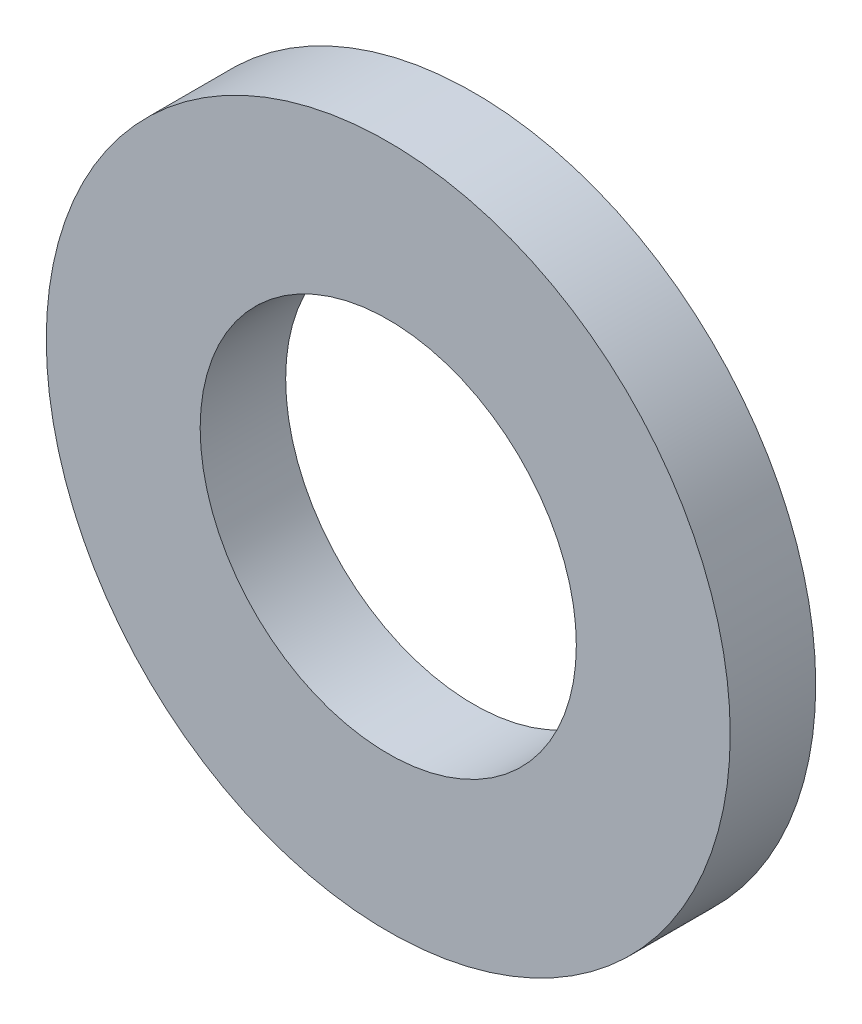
ISO-10303-21;
HEADER;
FILE_DESCRIPTION(('STEP AP214'),'2;1');
FILE_NAME('part.step','',(''),(''),'','','');
FILE_SCHEMA(('AUTOMOTIVE_DESIGN { 1 0 10303 214 1 1 1 1 }'));
ENDSEC;
DATA;
#1=APPLICATION_CONTEXT('core data for automotive mechanical design processes');
#2=APPLICATION_PROTOCOL_DEFINITION('international standard','automotive_design',2000,#1);
#3=PRODUCT_CONTEXT('',#1,'mechanical');
#4=PRODUCT('Part','Part','',(#3));
#5=PRODUCT_RELATED_PRODUCT_CATEGORY('part','',(#4));
#6=PRODUCT_DEFINITION_FORMATION('','',#4);
#7=PRODUCT_DEFINITION_CONTEXT('part definition',#1,'design');
#8=PRODUCT_DEFINITION('design','',#6,#7);
#9=PRODUCT_DEFINITION_SHAPE('','',#8);
#10=(LENGTH_UNIT() NAMED_UNIT(*) SI_UNIT(.MILLI.,.METRE.));
#11=(NAMED_UNIT(*) PLANE_ANGLE_UNIT() SI_UNIT($,.RADIAN.));
#12=(NAMED_UNIT(*) SI_UNIT($,.STERADIAN.) SOLID_ANGLE_UNIT());
#13=UNCERTAINTY_MEASURE_WITH_UNIT(LENGTH_MEASURE(1.E-05),#10,'distance_accuracy_value','');
#14=(GEOMETRIC_REPRESENTATION_CONTEXT(3) GLOBAL_UNCERTAINTY_ASSIGNED_CONTEXT((#13)) GLOBAL_UNIT_ASSIGNED_CONTEXT((#10,
#11,#12)) REPRESENTATION_CONTEXT('',''));
#15=CARTESIAN_POINT('',(0.,0.,0.));
#16=DIRECTION('',(0.,0.,1.));
#17=DIRECTION('',(1.,0.,0.));
#18=AXIS2_PLACEMENT_3D('',#15,#16,#17);
#19=CARTESIAN_POINT('',(0.,0.,0.5));
#20=DIRECTION('',(0.,0.,1.));
#21=DIRECTION('',(1.,0.,0.));
#22=AXIS2_PLACEMENT_3D('',#19,#20,#21);
#23=PLANE('',#22);
#24=CARTESIAN_POINT('',(0.,0.,0.5));
#25=DIRECTION('',(0.,0.,1.));
#26=DIRECTION('',(1.,0.,0.));
#27=AXIS2_PLACEMENT_3D('',#24,#25,#26);
#28=CIRCLE('',#27,2.);
#29=CARTESIAN_POINT('',(2.,0.,0.5));
#30=VERTEX_POINT('',#29);
#31=EDGE_CURVE('E10',#30,#30,#28,.T.);
#32=ORIENTED_EDGE('',*,*,#31,.T.);
#33=EDGE_LOOP('',(#32));
#34=FACE_BOUND('',#33,.T.);
#35=CARTESIAN_POINT('',(0.,0.,0.5));
#36=DIRECTION('',(0.,0.,1.));
#37=DIRECTION('',(1.,0.,0.));
#38=AXIS2_PLACEMENT_3D('',#35,#36,#37);
#39=CIRCLE('',#38,1.1);
#40=CARTESIAN_POINT('',(1.1,0.,0.5));
#41=VERTEX_POINT('',#40);
#42=EDGE_CURVE('E35',#41,#41,#39,.T.);
#43=ORIENTED_EDGE('',*,*,#42,.F.);
#44=EDGE_LOOP('',(#43));
#45=FACE_BOUND('',#44,.T.);
#46=ADVANCED_FACE('F24',(#34,#45),#23,.T.);
#47=CARTESIAN_POINT('',(0.,0.,0.));
#48=DIRECTION('',(0.,0.,1.));
#49=DIRECTION('',(1.,0.,0.));
#50=AXIS2_PLACEMENT_3D('',#47,#48,#49);
#51=PLANE('',#50);
#52=CARTESIAN_POINT('',(0.,0.,0.));
#53=DIRECTION('',(0.,0.,1.));
#54=DIRECTION('',(1.,0.,0.));
#55=AXIS2_PLACEMENT_3D('',#52,#53,#54);
#56=CIRCLE('',#55,2.);
#57=CARTESIAN_POINT('',(2.,0.,0.));
#58=VERTEX_POINT('',#57);
#59=EDGE_CURVE('E31',#58,#58,#56,.T.);
#60=ORIENTED_EDGE('',*,*,#59,.F.);
#61=EDGE_LOOP('',(#60));
#62=FACE_BOUND('',#61,.T.);
#63=CARTESIAN_POINT('',(0.,0.,0.));
#64=DIRECTION('',(0.,0.,1.));
#65=DIRECTION('',(1.,0.,0.));
#66=AXIS2_PLACEMENT_3D('',#63,#64,#65);
#67=CIRCLE('',#66,1.1);
#68=CARTESIAN_POINT('',(1.1,0.,0.));
#69=VERTEX_POINT('',#68);
#70=EDGE_CURVE('E39',#69,#69,#67,.T.);
#71=ORIENTED_EDGE('',*,*,#70,.T.);
#72=EDGE_LOOP('',(#71));
#73=FACE_BOUND('',#72,.T.);
#74=ADVANCED_FACE('F45',(#62,#73),#51,.F.);
#75=CARTESIAN_POINT('',(0.,0.,0.5));
#76=DIRECTION('',(0.,0.,-1.));
#77=DIRECTION('',(-1.,0.,0.));
#78=AXIS2_PLACEMENT_3D('',#75,#76,#77);
#79=CYLINDRICAL_SURFACE('',#78,2.);
#80=ORIENTED_EDGE('',*,*,#31,.F.);
#81=EDGE_LOOP('',(#80));
#82=FACE_BOUND('',#81,.T.);
#83=ORIENTED_EDGE('',*,*,#59,.T.);
#84=EDGE_LOOP('',(#83));
#85=FACE_BOUND('',#84,.T.);
#86=ADVANCED_FACE('F26',(#82,#85),#79,.T.);
#87=CARTESIAN_POINT('',(0.,0.,0.5));
#88=DIRECTION('',(0.,0.,-1.));
#89=DIRECTION('',(-1.,0.,0.));
#90=AXIS2_PLACEMENT_3D('',#87,#88,#89);
#91=CYLINDRICAL_SURFACE('',#90,1.1);
#92=ORIENTED_EDGE('',*,*,#42,.T.);
#93=EDGE_LOOP('',(#92));
#94=FACE_BOUND('',#93,.T.);
#95=ORIENTED_EDGE('',*,*,#70,.F.);
#96=EDGE_LOOP('',(#95));
#97=FACE_BOUND('',#96,.T.);
#98=ADVANCED_FACE('F47',(#94,#97),#91,.F.);
#99=CLOSED_SHELL('',(#46,#74,#86,#98));
#100=MANIFOLD_SOLID_BREP('B2',#99);
#101=ADVANCED_BREP_SHAPE_REPRESENTATION('',(#18,#100),#14);
#102=SHAPE_DEFINITION_REPRESENTATION(#9,#101);
ENDSEC;
END-ISO-10303-21;
